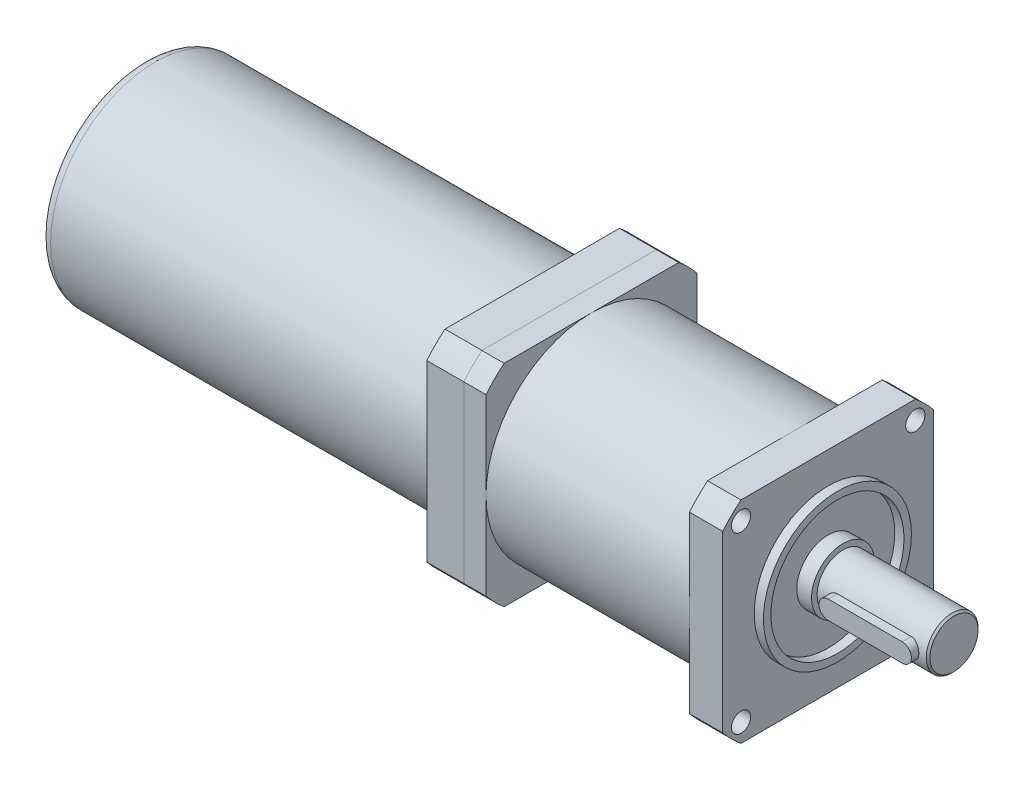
from build123d import *

# Parameters (mm, degrees)
EXTRUDE_1_DEPTH     = 9
SKETCH_2_R          = 28.5
EXTRUDE_2_DEPTH     = 55
EXTRUDE_3_DEPTH     = 6
SKETCH_6_R          = 2.6
CUT_EXTRUDE_2_DEPTH = 9
SKETCH_7_R          = 20
SKETCH_7_R_2        = 18
EXTRUDE_5_DEPTH     = 2.5
SKETCH_8_R          = 8.5
EXTRUDE_6_DEPTH     = 4
SKETCH_9_R          = 7
EXTRUDE_7_DEPTH     = 30
CUT_EXTRUDE_3_DEPTH = 3
EXTRUDE_START       = 5
EXTRUDE_8_DEPTH     = 5
CHAMFER_1_SIZE      = 0.5
EXTRUDE_9_DEPTH     = 10
SKETCH_15_R         = 28.2
EXTRUDE_10_DEPTH    = 105
FILLET_1_R          = 3


with BuildPart() as part:
    # Sketch 1 → Extrude 1 (new body)
    with BuildSketch(Plane(origin=(0, 0, 0), x_dir=(0, 0, -1), z_dir=(1, 0, 0))):
        with BuildLine():
            Line((-23.595550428, -28.5), (23.595550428, -28.5))
            ThreePointArc((23.595550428, -28.5), (26.162950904, -26.162950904), (28.5, -23.595550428))
            Line((28.5, -23.595550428), (28.5, 23.595550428))
            ThreePointArc((28.5, 23.595550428), (26.162950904, 26.162950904), (23.595550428, 28.5))
            Line((23.595550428, 28.5), (-23.595550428, 28.5))
            ThreePointArc((-23.595550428, 28.5), (-26.162950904, 26.162950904), (-28.5, 23.595550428))
            Line((-28.5, 23.595550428), (-28.5, -23.595550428))
            ThreePointArc((-28.5, -23.595550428), (-26.162950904, -26.162950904), (-23.595550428, -28.5))
        make_face()
    extrude(amount=-EXTRUDE_1_DEPTH)

    # Sketch 2 → Extrude 2 (add)
    with BuildSketch(Plane.ZY.offset(9)):
        Circle(SKETCH_2_R)
    extrude(amount=EXTRUDE_2_DEPTH)

    # Sketch 3 → Extrude 3 (add)
    with BuildSketch(Plane.ZY.offset(64)):
        with BuildLine():
            Line((-23.595550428, -28.5), (23.595550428, -28.5))
            ThreePointArc((23.595550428, -28.5), (26.162950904, -26.162950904), (28.5, -23.595550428))
            Line((28.5, -23.595550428), (28.5, 23.595550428))
            ThreePointArc((28.5, 23.595550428), (26.162950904, 26.162950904), (23.595550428, 28.5))
            Line((23.595550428, 28.5), (-23.595550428, 28.5))
            ThreePointArc((-23.595550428, 28.5), (-26.162950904, 26.162950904), (-28.5, 23.595550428))
            Line((-28.5, 23.595550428), (-28.5, -23.595550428))
            ThreePointArc((-28.5, -23.595550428), (-26.162950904, -26.162950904), (-23.595550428, -28.5))
        make_face()
    extrude(amount=EXTRUDE_3_DEPTH)

    # Sketch 6 → Cut-Extrude 2 (cut)
    with BuildSketch(Plane(origin=(0, 0, 0), x_dir=(0, 0, -1), z_dir=(1, 0, 0))):
        with Locations((-23.55, 23.55)):
            Circle(SKETCH_6_R)
        with Locations((23.55, 23.55)):
            Circle(SKETCH_6_R)
        with Locations((23.55, -23.55)):
            Circle(SKETCH_6_R)
        with Locations((-23.55, -23.55)):
            Circle(SKETCH_6_R)
    extrude(amount=-CUT_EXTRUDE_2_DEPTH, mode=Mode.SUBTRACT)

    # Sketch 7 → Extrude 5 (add)
    with BuildSketch(Plane(origin=(0, 0, 0), x_dir=(0, 0, -1), z_dir=(1, 0, 0))):
        Circle(SKETCH_7_R)
        Circle(SKETCH_7_R_2, mode=Mode.SUBTRACT)
    extrude(amount=EXTRUDE_5_DEPTH)

    # Sketch 8 → Extrude 6 (add)
    with BuildSketch(Plane(origin=(0, 0, 0), x_dir=(0, 0, -1), z_dir=(1, 0, 0))):
        Circle(SKETCH_8_R)
    extrude(amount=EXTRUDE_6_DEPTH)

    # Sketch 9 → Extrude 7 (add)
    with BuildSketch(Plane(origin=(4, 0, 0), x_dir=(0, 0, -1), z_dir=(1, 0, 0))):
        Circle(SKETCH_9_R)
    extrude(amount=EXTRUDE_7_DEPTH)

    # Sketch 10 → Cut-Extrude 3 (cut)
    with BuildSketch(Plane.XY.offset(7)):
        with BuildLine():
            Line((9, 2.5), (29, 2.5))
            ThreePointArc((29, 2.5), (31.5, 0), (29, -2.5))
            Line((29, -2.5), (9, -2.5))
            ThreePointArc((9, -2.5), (6.5, 0), (9, 2.5))
        make_face()
    extrude(amount=-CUT_EXTRUDE_3_DEPTH, mode=Mode.SUBTRACT)

    # Sketch 11 → Extrude 8 (add)
    with BuildSketch(Plane.XY.offset(4).offset(EXTRUDE_START)):
        with BuildLine():
            Line((9, 2.5), (29, 2.5))
            ThreePointArc((29, 2.5), (31.5, 0), (29, -2.5))
            Line((29, -2.5), (9, -2.5))
            ThreePointArc((9, -2.5), (6.5, 0), (9, 2.5))
        make_face()
    extrude(amount=-EXTRUDE_8_DEPTH)

    # Chamfer 1
    chamfer_1_edges = [part.edges().sort_by_distance(p)[0] for p in [
        (34, 0, 7),
    ]]
    chamfer(chamfer_1_edges, length=CHAMFER_1_SIZE)


with BuildPart() as body_2:
    # Sketch 14 → Extrude 9 (new body)
    with BuildSketch(Plane.ZY.offset(70)):
        with BuildLine():
            Line((-23.595550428, -28.5), (23.595550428, -28.5))
            ThreePointArc((23.595550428, -28.5), (26.162950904, -26.162950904), (28.5, -23.595550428))
            Line((28.5, -23.595550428), (28.5, 23.595550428))
            ThreePointArc((28.5, 23.595550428), (26.162950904, 26.162950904), (23.595550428, 28.5))
            Line((23.595550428, 28.5), (-23.595550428, 28.5))
            ThreePointArc((-23.595550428, 28.5), (-26.162950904, 26.162950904), (-28.5, 23.595550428))
            Line((-28.5, 23.595550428), (-28.5, -23.595550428))
            ThreePointArc((-28.5, -23.595550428), (-26.162950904, -26.162950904), (-23.595550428, -28.5))
        make_face()
    extrude(amount=EXTRUDE_9_DEPTH)

    # Sketch 15 → Extrude 10 (add)
    with BuildSketch(Plane.ZY.offset(80)):
        Circle(SKETCH_15_R)
    extrude(amount=EXTRUDE_10_DEPTH)

    # Fillet 1
    fillet_1_edges = [body_2.edges().sort_by_distance(p)[0] for p in [
        (-185, 0, -28.2),
    ]]
    fillet(fillet_1_edges, radius=FILLET_1_R)


solid = Compound([part.part, body_2.part])
